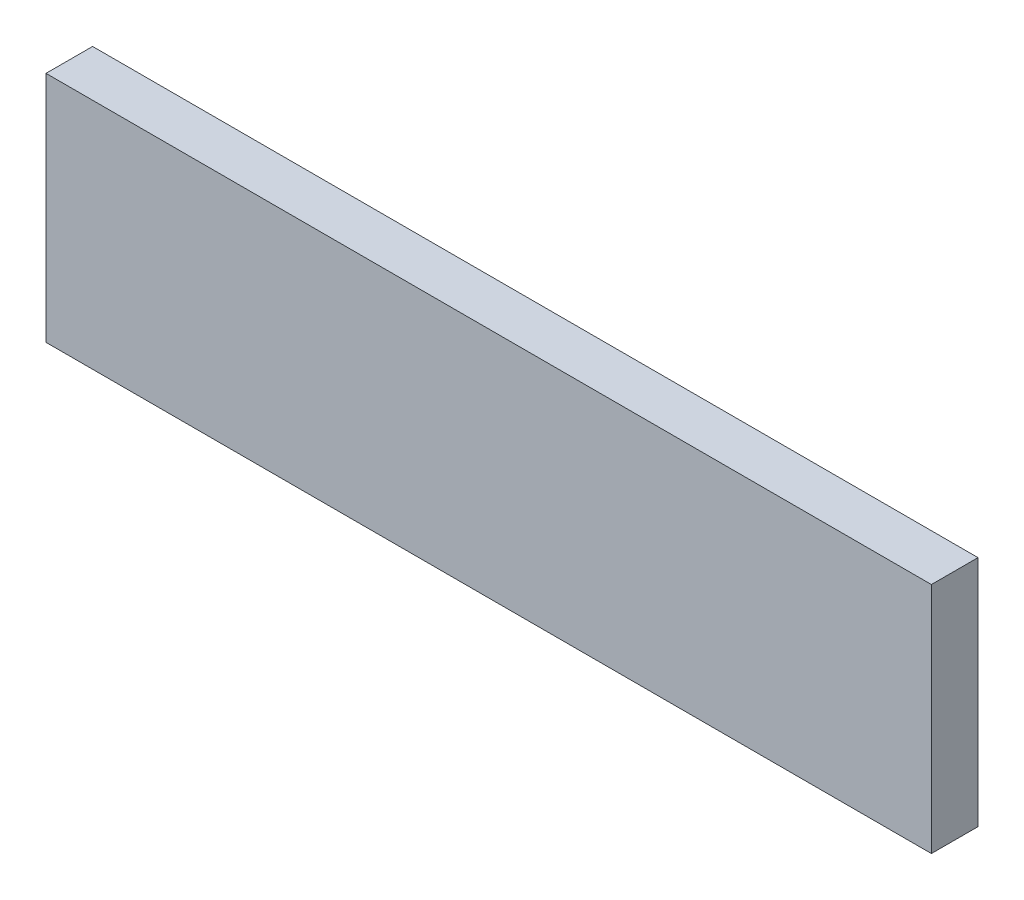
ISO-10303-21;
HEADER;
FILE_DESCRIPTION(('STEP AP214'),'2;1');
FILE_NAME('part.step','',(''),(''),'','','');
FILE_SCHEMA(('AUTOMOTIVE_DESIGN { 1 0 10303 214 1 1 1 1 }'));
ENDSEC;
DATA;
#1=APPLICATION_CONTEXT('core data for automotive mechanical design processes');
#2=APPLICATION_PROTOCOL_DEFINITION('international standard','automotive_design',2000,#1);
#3=PRODUCT_CONTEXT('',#1,'mechanical');
#4=PRODUCT('Part','Part','',(#3));
#5=PRODUCT_RELATED_PRODUCT_CATEGORY('part','',(#4));
#6=PRODUCT_DEFINITION_FORMATION('','',#4);
#7=PRODUCT_DEFINITION_CONTEXT('part definition',#1,'design');
#8=PRODUCT_DEFINITION('design','',#6,#7);
#9=PRODUCT_DEFINITION_SHAPE('','',#8);
#10=(LENGTH_UNIT() NAMED_UNIT(*) SI_UNIT(.MILLI.,.METRE.));
#11=(NAMED_UNIT(*) PLANE_ANGLE_UNIT() SI_UNIT($,.RADIAN.));
#12=(NAMED_UNIT(*) SI_UNIT($,.STERADIAN.) SOLID_ANGLE_UNIT());
#13=UNCERTAINTY_MEASURE_WITH_UNIT(LENGTH_MEASURE(1.E-05),#10,'distance_accuracy_value','');
#14=(GEOMETRIC_REPRESENTATION_CONTEXT(3) GLOBAL_UNCERTAINTY_ASSIGNED_CONTEXT((#13)) GLOBAL_UNIT_ASSIGNED_CONTEXT((#10,
#11,#12)) REPRESENTATION_CONTEXT('',''));
#15=CARTESIAN_POINT('',(0.,0.,0.));
#16=DIRECTION('',(0.,0.,1.));
#17=DIRECTION('',(1.,0.,0.));
#18=AXIS2_PLACEMENT_3D('',#15,#16,#17);
#19=CARTESIAN_POINT('',(-60.,30.,6.));
#20=DIRECTION('',(1.,0.,0.));
#21=DIRECTION('',(0.,1.,0.));
#22=AXIS2_PLACEMENT_3D('',#19,#20,#21);
#23=PLANE('',#22);
#24=DIRECTION('',(0.,-1.,0.));
#25=VECTOR('',#24,1.);
#26=CARTESIAN_POINT('',(-60.,30.,0.));
#27=LINE('',#26,#25);
#28=CARTESIAN_POINT('',(-60.,30.,0.));
#29=VERTEX_POINT('',#28);
#30=CARTESIAN_POINT('',(-60.,0.,0.));
#31=VERTEX_POINT('',#30);
#32=EDGE_CURVE('E70',#29,#31,#27,.T.);
#33=ORIENTED_EDGE('',*,*,#32,.T.);
#34=DIRECTION('',(0.,0.,-1.));
#35=VECTOR('',#34,1.);
#36=CARTESIAN_POINT('',(-60.,0.,6.));
#37=LINE('',#36,#35);
#38=CARTESIAN_POINT('',(-60.,0.,6.));
#39=VERTEX_POINT('',#38);
#40=EDGE_CURVE('E11',#39,#31,#37,.T.);
#41=ORIENTED_EDGE('',*,*,#40,.F.);
#42=DIRECTION('',(0.,-1.,0.));
#43=VECTOR('',#42,1.);
#44=CARTESIAN_POINT('',(-60.,30.,6.));
#45=LINE('',#44,#43);
#46=CARTESIAN_POINT('',(-60.,30.,6.));
#47=VERTEX_POINT('',#46);
#48=EDGE_CURVE('E88',#47,#39,#45,.T.);
#49=ORIENTED_EDGE('',*,*,#48,.F.);
#50=DIRECTION('',(0.,0.,-1.));
#51=VECTOR('',#50,1.);
#52=CARTESIAN_POINT('',(-60.,30.,6.));
#53=LINE('',#52,#51);
#54=EDGE_CURVE('E82',#47,#29,#53,.T.);
#55=ORIENTED_EDGE('',*,*,#54,.T.);
#56=EDGE_LOOP('',(#33,#41,#49,#55));
#57=FACE_BOUND('',#56,.T.);
#58=ADVANCED_FACE('F26',(#57),#23,.F.);
#59=CARTESIAN_POINT('',(-60.,0.,6.));
#60=DIRECTION('',(0.,1.,0.));
#61=DIRECTION('',(0.,0.,1.));
#62=AXIS2_PLACEMENT_3D('',#59,#60,#61);
#63=PLANE('',#62);
#64=DIRECTION('',(1.,0.,0.));
#65=VECTOR('',#64,1.);
#66=CARTESIAN_POINT('',(-60.,0.,0.));
#67=LINE('',#66,#65);
#68=CARTESIAN_POINT('',(54.,0.,0.));
#69=VERTEX_POINT('',#68);
#70=EDGE_CURVE('E66',#31,#69,#67,.T.);
#71=ORIENTED_EDGE('',*,*,#70,.T.);
#72=DIRECTION('',(0.,0.,-1.));
#73=VECTOR('',#72,1.);
#74=CARTESIAN_POINT('',(54.,0.,6.));
#75=LINE('',#74,#73);
#76=CARTESIAN_POINT('',(54.,0.,6.));
#77=VERTEX_POINT('',#76);
#78=EDGE_CURVE('E33',#77,#69,#75,.T.);
#79=ORIENTED_EDGE('',*,*,#78,.F.);
#80=DIRECTION('',(1.,0.,0.));
#81=VECTOR('',#80,1.);
#82=CARTESIAN_POINT('',(-60.,0.,6.));
#83=LINE('',#82,#81);
#84=EDGE_CURVE('E78',#39,#77,#83,.T.);
#85=ORIENTED_EDGE('',*,*,#84,.F.);
#86=ORIENTED_EDGE('',*,*,#40,.T.);
#87=EDGE_LOOP('',(#71,#79,#85,#86));
#88=FACE_BOUND('',#87,.T.);
#89=ADVANCED_FACE('F77',(#88),#63,.F.);
#90=CARTESIAN_POINT('',(54.,30.,6.));
#91=DIRECTION('',(-1.,0.,0.));
#92=DIRECTION('',(0.,0.,1.));
#93=AXIS2_PLACEMENT_3D('',#90,#91,#92);
#94=PLANE('',#93);
#95=DIRECTION('',(0.,1.,0.));
#96=VECTOR('',#95,1.);
#97=CARTESIAN_POINT('',(54.,30.,0.));
#98=LINE('',#97,#96);
#99=CARTESIAN_POINT('',(54.,30.,0.));
#100=VERTEX_POINT('',#99);
#101=EDGE_CURVE('E71',#69,#100,#98,.T.);
#102=ORIENTED_EDGE('',*,*,#101,.T.);
#103=DIRECTION('',(0.,0.,-1.));
#104=VECTOR('',#103,1.);
#105=CARTESIAN_POINT('',(54.,30.,6.));
#106=LINE('',#105,#104);
#107=CARTESIAN_POINT('',(54.,30.,6.));
#108=VERTEX_POINT('',#107);
#109=EDGE_CURVE('E94',#108,#100,#106,.T.);
#110=ORIENTED_EDGE('',*,*,#109,.F.);
#111=DIRECTION('',(0.,1.,0.));
#112=VECTOR('',#111,1.);
#113=CARTESIAN_POINT('',(54.,30.,6.));
#114=LINE('',#113,#112);
#115=EDGE_CURVE('E45',#77,#108,#114,.T.);
#116=ORIENTED_EDGE('',*,*,#115,.F.);
#117=ORIENTED_EDGE('',*,*,#78,.T.);
#118=EDGE_LOOP('',(#102,#110,#116,#117));
#119=FACE_BOUND('',#118,.T.);
#120=ADVANCED_FACE('F97',(#119),#94,.F.);
#121=CARTESIAN_POINT('',(-60.,30.,6.));
#122=DIRECTION('',(0.,-1.,0.));
#123=DIRECTION('',(0.,0.,-1.));
#124=AXIS2_PLACEMENT_3D('',#121,#122,#123);
#125=PLANE('',#124);
#126=DIRECTION('',(-1.,0.,0.));
#127=VECTOR('',#126,1.);
#128=CARTESIAN_POINT('',(-60.,30.,0.));
#129=LINE('',#128,#127);
#130=EDGE_CURVE('E86',#100,#29,#129,.T.);
#131=ORIENTED_EDGE('',*,*,#130,.T.);
#132=ORIENTED_EDGE('',*,*,#54,.F.);
#133=DIRECTION('',(-1.,0.,0.));
#134=VECTOR('',#133,1.);
#135=CARTESIAN_POINT('',(-60.,30.,6.));
#136=LINE('',#135,#134);
#137=EDGE_CURVE('E40',#108,#47,#136,.T.);
#138=ORIENTED_EDGE('',*,*,#137,.F.);
#139=ORIENTED_EDGE('',*,*,#109,.T.);
#140=EDGE_LOOP('',(#131,#132,#138,#139));
#141=FACE_BOUND('',#140,.T.);
#142=ADVANCED_FACE('F99',(#141),#125,.F.);
#143=CARTESIAN_POINT('',(-60.,30.,6.));
#144=DIRECTION('',(0.,0.,1.));
#145=DIRECTION('',(1.,0.,0.));
#146=AXIS2_PLACEMENT_3D('',#143,#144,#145);
#147=PLANE('',#146);
#148=ORIENTED_EDGE('',*,*,#48,.T.);
#149=ORIENTED_EDGE('',*,*,#84,.T.);
#150=ORIENTED_EDGE('',*,*,#115,.T.);
#151=ORIENTED_EDGE('',*,*,#137,.T.);
#152=EDGE_LOOP('',(#148,#149,#150,#151));
#153=FACE_BOUND('',#152,.T.);
#154=ADVANCED_FACE('F100',(#153),#147,.T.);
#155=CARTESIAN_POINT('',(-60.,30.,0.));
#156=DIRECTION('',(0.,0.,1.));
#157=DIRECTION('',(1.,0.,0.));
#158=AXIS2_PLACEMENT_3D('',#155,#156,#157);
#159=PLANE('',#158);
#160=ORIENTED_EDGE('',*,*,#32,.F.);
#161=ORIENTED_EDGE('',*,*,#130,.F.);
#162=ORIENTED_EDGE('',*,*,#101,.F.);
#163=ORIENTED_EDGE('',*,*,#70,.F.);
#164=EDGE_LOOP('',(#160,#161,#162,#163));
#165=FACE_BOUND('',#164,.T.);
#166=ADVANCED_FACE('F67',(#165),#159,.F.);
#167=CLOSED_SHELL('',(#58,#89,#120,#142,#154,#166));
#168=MANIFOLD_SOLID_BREP('B2',#167);
#169=ADVANCED_BREP_SHAPE_REPRESENTATION('',(#18,#168),#14);
#170=SHAPE_DEFINITION_REPRESENTATION(#9,#169);
ENDSEC;
END-ISO-10303-21;
